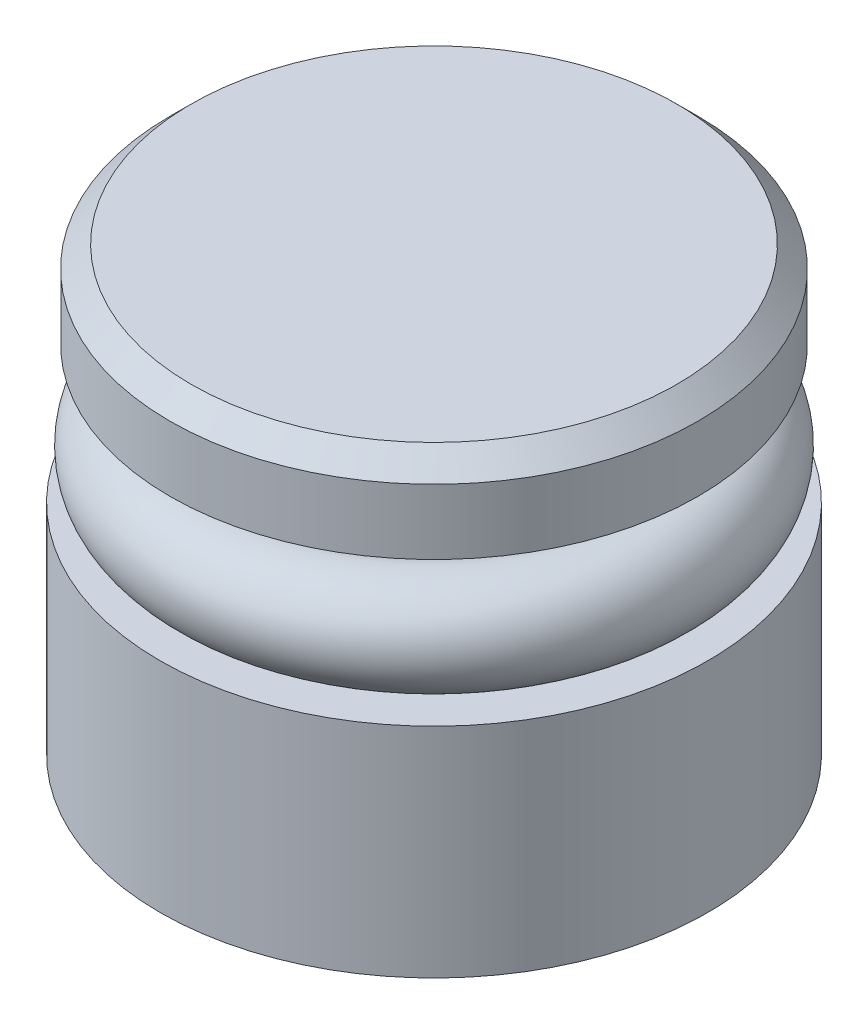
ISO-10303-21;
HEADER;
FILE_DESCRIPTION(('STEP AP214'),'2;1');
FILE_NAME('part.step','',(''),(''),'','','');
FILE_SCHEMA(('AUTOMOTIVE_DESIGN { 1 0 10303 214 1 1 1 1 }'));
ENDSEC;
DATA;
#1=APPLICATION_CONTEXT('core data for automotive mechanical design processes');
#2=APPLICATION_PROTOCOL_DEFINITION('international standard','automotive_design',2000,#1);
#3=PRODUCT_CONTEXT('',#1,'mechanical');
#4=PRODUCT('Part','Part','',(#3));
#5=PRODUCT_RELATED_PRODUCT_CATEGORY('part','',(#4));
#6=PRODUCT_DEFINITION_FORMATION('','',#4);
#7=PRODUCT_DEFINITION_CONTEXT('part definition',#1,'design');
#8=PRODUCT_DEFINITION('design','',#6,#7);
#9=PRODUCT_DEFINITION_SHAPE('','',#8);
#10=(LENGTH_UNIT() NAMED_UNIT(*) SI_UNIT(.MILLI.,.METRE.));
#11=(NAMED_UNIT(*) PLANE_ANGLE_UNIT() SI_UNIT($,.RADIAN.));
#12=(NAMED_UNIT(*) SI_UNIT($,.STERADIAN.) SOLID_ANGLE_UNIT());
#13=UNCERTAINTY_MEASURE_WITH_UNIT(LENGTH_MEASURE(1.E-05),#10,'distance_accuracy_value','');
#14=(GEOMETRIC_REPRESENTATION_CONTEXT(3) GLOBAL_UNCERTAINTY_ASSIGNED_CONTEXT((#13)) GLOBAL_UNIT_ASSIGNED_CONTEXT((#10,
#11,#12)) REPRESENTATION_CONTEXT('',''));
#15=CARTESIAN_POINT('',(0.,0.,0.));
#16=DIRECTION('',(0.,0.,1.));
#17=DIRECTION('',(1.,0.,0.));
#18=AXIS2_PLACEMENT_3D('',#15,#16,#17);
#19=CARTESIAN_POINT('',(0.,0.,0.));
#20=DIRECTION('',(0.,-1.,0.));
#21=DIRECTION('',(0.,0.,-1.));
#22=AXIS2_PLACEMENT_3D('',#19,#20,#21);
#23=PLANE('',#22);
#24=CARTESIAN_POINT('',(0.,0.,0.));
#25=DIRECTION('',(0.,-1.,0.));
#26=DIRECTION('',(0.,0.,-1.));
#27=AXIS2_PLACEMENT_3D('',#24,#25,#26);
#28=CIRCLE('',#27,2.0193);
#29=CARTESIAN_POINT('',(0.,0.,-2.0193));
#30=VERTEX_POINT('',#29);
#31=EDGE_CURVE('P0_E37',#30,#30,#28,.T.);
#32=ORIENTED_EDGE('',*,*,#31,.F.);
#33=EDGE_LOOP('',(#32));
#34=FACE_BOUND('',#33,.T.);
#35=CARTESIAN_POINT('',(0.,0.,0.));
#36=DIRECTION('',(0.,-1.,0.));
#37=DIRECTION('',(0.,0.,-1.));
#38=AXIS2_PLACEMENT_3D('',#35,#36,#37);
#39=CIRCLE('',#38,4.9149);
#40=CARTESIAN_POINT('',(0.,0.,-4.9149));
#41=VERTEX_POINT('',#40);
#42=EDGE_CURVE('P0_E53',#41,#41,#39,.T.);
#43=ORIENTED_EDGE('',*,*,#42,.T.);
#44=EDGE_LOOP('',(#43));
#45=FACE_BOUND('',#44,.T.);
#46=ADVANCED_FACE('P0_F16',(#34,#45),#23,.T.);
#47=CARTESIAN_POINT('',(0.,0.,0.));
#48=DIRECTION('',(0.,-1.,0.));
#49=DIRECTION('',(0.,0.,-1.));
#50=AXIS2_PLACEMENT_3D('',#47,#48,#49);
#51=CYLINDRICAL_SURFACE('',#50,4.9149);
#52=CARTESIAN_POINT('',(0.,3.9116,0.));
#53=DIRECTION('',(0.,-1.,0.));
#54=DIRECTION('',(0.,0.,-1.));
#55=AXIS2_PLACEMENT_3D('',#52,#53,#54);
#56=CIRCLE('',#55,4.9149);
#57=CARTESIAN_POINT('',(0.,3.9116,-4.9149));
#58=VERTEX_POINT('',#57);
#59=EDGE_CURVE('P0_E50',#58,#58,#56,.T.);
#60=ORIENTED_EDGE('',*,*,#59,.T.);
#61=EDGE_LOOP('',(#60));
#62=FACE_BOUND('',#61,.T.);
#63=ORIENTED_EDGE('',*,*,#42,.F.);
#64=EDGE_LOOP('',(#63));
#65=FACE_BOUND('',#64,.T.);
#66=ADVANCED_FACE('P0_F70',(#62,#65),#51,.T.);
#67=CARTESIAN_POINT('',(4.9149,3.9116,0.));
#68=DIRECTION('',(0.,1.,0.));
#69=DIRECTION('',(0.,0.,1.));
#70=AXIS2_PLACEMENT_3D('',#67,#68,#69);
#71=PLANE('',#70);
#72=CARTESIAN_POINT('',(0.,3.9116,0.));
#73=DIRECTION('',(0.,-1.,0.));
#74=DIRECTION('',(0.,0.,-1.));
#75=AXIS2_PLACEMENT_3D('',#72,#73,#74);
#76=CIRCLE('',#75,3.4036);
#77=CARTESIAN_POINT('',(0.,3.9116,-3.4036));
#78=VERTEX_POINT('',#77);
#79=EDGE_CURVE('P0_E47',#78,#78,#76,.T.);
#80=ORIENTED_EDGE('',*,*,#79,.T.);
#81=EDGE_LOOP('',(#80));
#82=FACE_BOUND('',#81,.T.);
#83=ORIENTED_EDGE('',*,*,#59,.F.);
#84=EDGE_LOOP('',(#83));
#85=FACE_BOUND('',#84,.T.);
#86=ADVANCED_FACE('P0_F75',(#82,#85),#71,.T.);
#87=CARTESIAN_POINT('',(0.,0.,0.));
#88=DIRECTION('',(0.,-1.,0.));
#89=DIRECTION('',(0.,0.,-1.));
#90=AXIS2_PLACEMENT_3D('',#87,#88,#89);
#91=CYLINDRICAL_SURFACE('',#90,3.4036);
#92=CARTESIAN_POINT('',(0.,6.3754,0.));
#93=DIRECTION('',(0.,-1.,0.));
#94=DIRECTION('',(0.,0.,-1.));
#95=AXIS2_PLACEMENT_3D('',#92,#93,#94);
#96=CIRCLE('',#95,3.4036);
#97=CARTESIAN_POINT('',(0.,6.3754,-3.4036));
#98=VERTEX_POINT('',#97);
#99=EDGE_CURVE('P0_E40',#98,#98,#96,.T.);
#100=ORIENTED_EDGE('',*,*,#99,.T.);
#101=EDGE_LOOP('',(#100));
#102=FACE_BOUND('',#101,.T.);
#103=ORIENTED_EDGE('',*,*,#79,.F.);
#104=EDGE_LOOP('',(#103));
#105=FACE_BOUND('',#104,.T.);
#106=ADVANCED_FACE('P0_F83',(#102,#105),#91,.T.);
#107=CARTESIAN_POINT('',(3.4036,6.3754,0.));
#108=DIRECTION('',(0.,-1.,0.));
#109=DIRECTION('',(0.,0.,-1.));
#110=AXIS2_PLACEMENT_3D('',#107,#108,#109);
#111=PLANE('',#110);
#112=CARTESIAN_POINT('',(0.,6.3754,0.));
#113=DIRECTION('',(0.,-1.,0.));
#114=DIRECTION('',(0.,0.,-1.));
#115=AXIS2_PLACEMENT_3D('',#112,#113,#114);
#116=CIRCLE('',#115,4.7371);
#117=CARTESIAN_POINT('',(0.,6.3754,-4.7371));
#118=VERTEX_POINT('',#117);
#119=EDGE_CURVE('P0_E36',#118,#118,#116,.T.);
#120=ORIENTED_EDGE('',*,*,#119,.T.);
#121=EDGE_LOOP('',(#120));
#122=FACE_BOUND('',#121,.T.);
#123=ORIENTED_EDGE('',*,*,#99,.F.);
#124=EDGE_LOOP('',(#123));
#125=FACE_BOUND('',#124,.T.);
#126=ADVANCED_FACE('P0_F87',(#122,#125),#111,.T.);
#127=CARTESIAN_POINT('',(0.,0.,0.));
#128=DIRECTION('',(0.,-1.,0.));
#129=DIRECTION('',(0.,0.,-1.));
#130=AXIS2_PLACEMENT_3D('',#127,#128,#129);
#131=CYLINDRICAL_SURFACE('',#130,4.7371);
#132=CARTESIAN_POINT('',(0.,7.5438,0.));
#133=DIRECTION('',(0.,1.,0.));
#134=DIRECTION('',(0.,0.,1.));
#135=AXIS2_PLACEMENT_3D('',#132,#133,#134);
#136=CIRCLE('',#135,4.7371);
#137=CARTESIAN_POINT('',(0.,7.5438,4.7371));
#138=VERTEX_POINT('',#137);
#139=EDGE_CURVE('P0_E23',#138,#138,#136,.F.);
#140=ORIENTED_EDGE('',*,*,#139,.T.);
#141=EDGE_LOOP('',(#140));
#142=FACE_BOUND('',#141,.T.);
#143=ORIENTED_EDGE('',*,*,#119,.F.);
#144=EDGE_LOOP('',(#143));
#145=FACE_BOUND('',#144,.T.);
#146=ADVANCED_FACE('P0_F58',(#142,#145),#131,.T.);
#147=CARTESIAN_POINT('',(4.7371,7.9248,0.));
#148=DIRECTION('',(0.,1.,0.));
#149=DIRECTION('',(0.,0.,1.));
#150=AXIS2_PLACEMENT_3D('',#147,#148,#149);
#151=PLANE('',#150);
#152=CARTESIAN_POINT('',(0.,7.9248,0.));
#153=DIRECTION('',(0.,1.,0.));
#154=DIRECTION('',(0.,0.,1.));
#155=AXIS2_PLACEMENT_3D('',#152,#153,#154);
#156=CIRCLE('',#155,4.3561);
#157=CARTESIAN_POINT('',(0.,7.9248,4.3561));
#158=VERTEX_POINT('',#157);
#159=EDGE_CURVE('P0_E11',#158,#158,#156,.T.);
#160=ORIENTED_EDGE('',*,*,#159,.T.);
#161=EDGE_LOOP('',(#160));
#162=FACE_BOUND('',#161,.T.);
#163=ADVANCED_FACE('P0_F30',(#162),#151,.T.);
#164=CARTESIAN_POINT('',(0.,5.08,0.));
#165=DIRECTION('',(0.,-1.,0.));
#166=DIRECTION('',(0.,0.,-1.));
#167=AXIS2_PLACEMENT_3D('',#164,#165,#166);
#168=CONICAL_SURFACE('',#167,2.0193,1.02974425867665);
#169=CARTESIAN_POINT('',(0.,6.29331784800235,0.));
#170=VERTEX_POINT('',#169);
#171=VERTEX_LOOP('',#170);
#172=FACE_BOUND('',#171,.T.);
#173=CARTESIAN_POINT('',(0.,5.08,0.));
#174=DIRECTION('',(0.,-1.,0.));
#175=DIRECTION('',(0.,0.,-1.));
#176=AXIS2_PLACEMENT_3D('',#173,#174,#175);
#177=CIRCLE('',#176,2.0193);
#178=CARTESIAN_POINT('',(0.,5.08,-2.0193));
#179=VERTEX_POINT('',#178);
#180=EDGE_CURVE('P0_E34',#179,#179,#177,.T.);
#181=ORIENTED_EDGE('',*,*,#180,.T.);
#182=EDGE_LOOP('',(#181));
#183=FACE_BOUND('',#182,.T.);
#184=ADVANCED_FACE('P0_F26',(#172,#183),#168,.F.);
#185=CARTESIAN_POINT('',(0.,0.,0.));
#186=DIRECTION('',(0.,-1.,0.));
#187=DIRECTION('',(0.,0.,-1.));
#188=AXIS2_PLACEMENT_3D('',#185,#186,#187);
#189=CYLINDRICAL_SURFACE('',#188,2.0193);
#190=ORIENTED_EDGE('',*,*,#180,.F.);
#191=EDGE_LOOP('',(#190));
#192=FACE_BOUND('',#191,.T.);
#193=ORIENTED_EDGE('',*,*,#31,.T.);
#194=EDGE_LOOP('',(#193));
#195=FACE_BOUND('',#194,.T.);
#196=ADVANCED_FACE('P0_F29',(#192,#195),#189,.F.);
#197=CARTESIAN_POINT('',(0.,7.5438,0.));
#198=DIRECTION('',(0.,-1.,0.));
#199=DIRECTION('',(0.,0.,-1.));
#200=AXIS2_PLACEMENT_3D('',#197,#198,#199);
#201=CONICAL_SURFACE('',#200,4.7371,0.785398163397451);
#202=ORIENTED_EDGE('',*,*,#159,.F.);
#203=EDGE_LOOP('',(#202));
#204=FACE_BOUND('',#203,.T.);
#205=ORIENTED_EDGE('',*,*,#139,.F.);
#206=EDGE_LOOP('',(#205));
#207=FACE_BOUND('',#206,.T.);
#208=ADVANCED_FACE('P0_F18',(#204,#207),#201,.T.);
#209=CLOSED_SHELL('',(#46,#66,#86,#106,#126,#146,#163,#184,#196,#208));
#210=MANIFOLD_SOLID_BREP('P0_B1',#209);
#211=CARTESIAN_POINT('',(0.,4.8006,0.));
#212=DIRECTION('',(0.,-1.,0.));
#213=DIRECTION('',(0.,0.,-1.));
#214=AXIS2_PLACEMENT_3D('',#211,#212,#213);
#215=TOROIDAL_SURFACE('',#214,3.9243,0.889);
#216=CARTESIAN_POINT('',(0.,4.8006,-4.8133));
#217=VERTEX_POINT('',#216);
#218=VERTEX_LOOP('',#217);
#219=FACE_BOUND('',#218,.T.);
#220=ADVANCED_FACE('P1_F12',(#219),#215,.T.);
#221=CLOSED_SHELL('',(#220));
#222=MANIFOLD_SOLID_BREP('P1_B1',#221);
#223=ADVANCED_BREP_SHAPE_REPRESENTATION('',(#18,#210,#222),#14);
#224=SHAPE_DEFINITION_REPRESENTATION(#9,#223);
ENDSEC;
END-ISO-10303-21;
